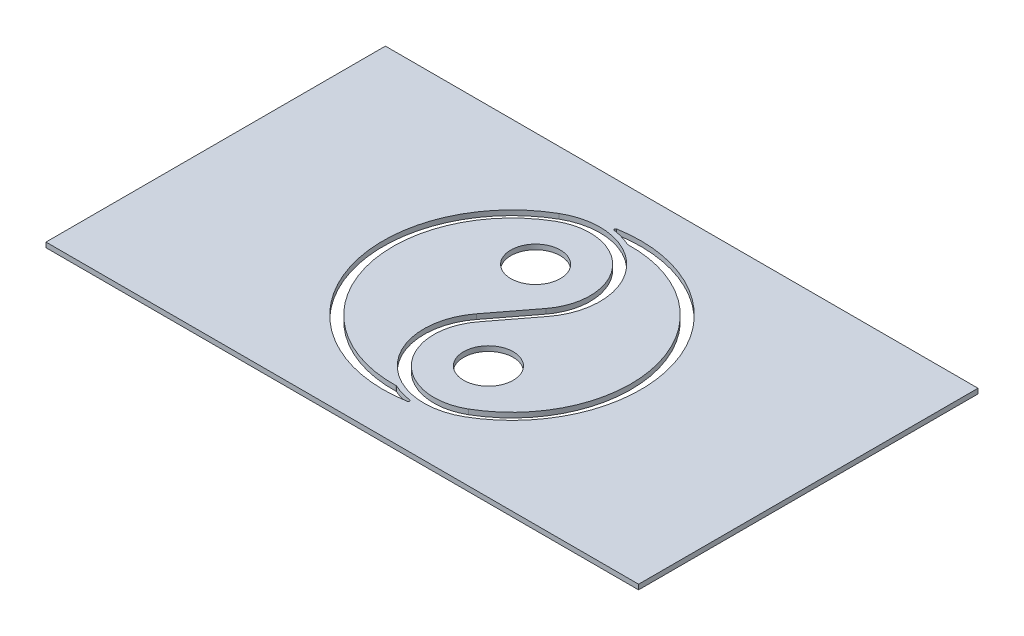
from build123d import *

# Parameters (mm, degrees)
SKIZZE1_W                       = 119.514241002
SKIZZE1_H                       = 68.450599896
LINEAR_AUSTRAGEN1_DEPTH         = 1
SKIZZE2_R                       = 5
SCHNITT_LINEAR_AUSTRAGEN1_DEPTH = 138.732125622
VERRUNDUNG1_R                   = 0.25


with BuildPart() as part:
    # Skizze1 → Linear austragen1 (new body)
    with BuildSketch(Plane(origin=(0, 0, 0), x_dir=(1, 0, 0), z_dir=(0, 1, 0))):
        with Locations((59.757120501, 34.225299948)):
            Rectangle(SKIZZE1_W, SKIZZE1_H)
    extrude(amount=LINEAR_AUSTRAGEN1_DEPTH)

    # Skizze2 → Schnitt-Linear austragen1 (cut, through all)
    with BuildSketch(Plane(origin=(0, 1, 0), x_dir=(-1, 0, 0), z_dir=(0, 1, 0))):
        with Locations(Location((-66.257120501, -22.966969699, 0), (0, 0, 90))):
            Circle(SKIZZE2_R)
        with Locations(Location((-53.257120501, -45.483630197, 0), (0, 0, 90))):
            Circle(SKIZZE2_R)
        with BuildLine():
            Line((-57.516243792, -29.645073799), (-63.58724752, -37.591325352))
            ThreePointArc((-63.58724752, -37.591325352), (-63.022066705, -54.065344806), (-46.757120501, -56.741960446))
            ThreePointArc((-46.757120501, -56.741960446), (-35.629310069, -24.537742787), (-65.937794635, -8.970611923))
            ThreePointArc((-65.937794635, -8.970611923), (-63.122138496, -9.322487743), (-60.435268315, -10.234882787))
            ThreePointArc((-60.435268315, -10.234882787), (-36.66498241, -27.68671001), (-47.757120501, -55.009909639))
            ThreePointArc((-47.757120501, -55.009909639), (-61.519767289, -52.74508102), (-61.997997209, -38.805526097))
            Line((-61.997997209, -38.805526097), (-55.926993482, -30.859274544))
            ThreePointArc((-55.926993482, -30.859274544), (-56.492174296, -14.38525509), (-72.757120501, -11.708639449))
            ThreePointArc((-72.757120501, -11.708639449), (-83.884930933, -43.912857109), (-53.576446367, -59.479987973))
            ThreePointArc((-53.576446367, -59.479987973), (-56.392102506, -59.128112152), (-59.078972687, -58.215717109))
            ThreePointArc((-59.078972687, -58.215717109), (-82.849258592, -40.763889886), (-71.757120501, -13.440690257))
            ThreePointArc((-71.757120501, -13.440690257), (-57.994473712, -15.705518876), (-57.516243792, -29.645073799))
        make_face()
    extrude(amount=-SCHNITT_LINEAR_AUSTRAGEN1_DEPTH, mode=Mode.SUBTRACT)

    # Verrundung1
    verrundung1_edges = [part.edges().sort_by_distance(p)[0] for p in [
        (59.078972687, 0.5, -58.215717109),
        (53.576446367, 0.5, -59.479987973),
        (60.435268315, 0.5, -10.234882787),
        (65.937794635, 0.5, -8.970611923),
    ]]
    fillet(verrundung1_edges, radius=VERRUNDUNG1_R)


solid = part.part
